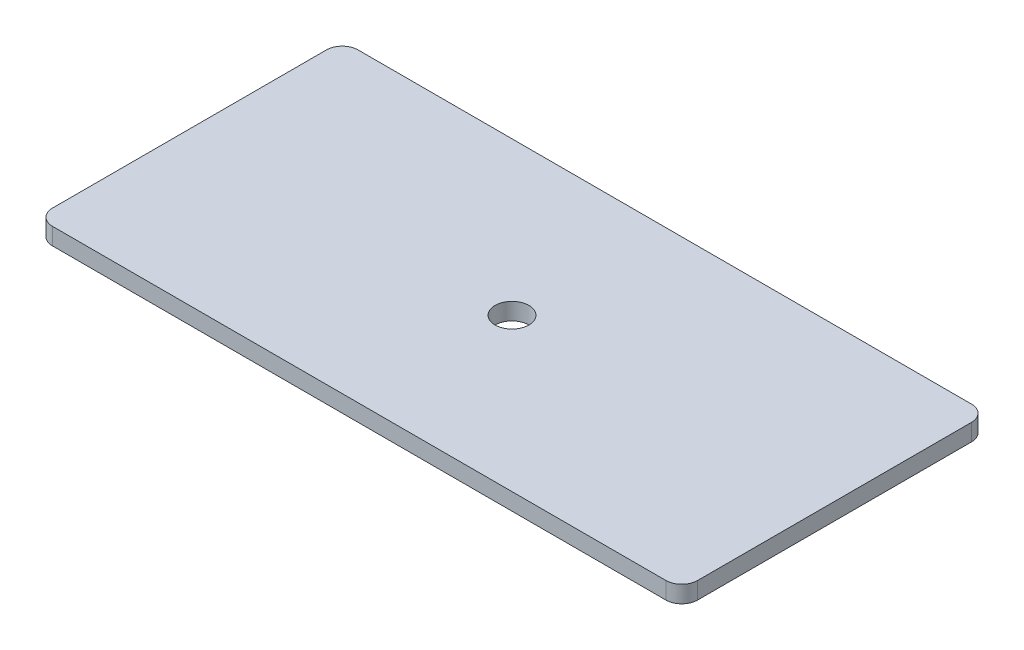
from build123d import *

# Parameters (mm, degrees)
BOSS_EXTRUDE1_DEPTH = 5
SKETCH2_R           = 5
CUT_EXTRUDE1_DEPTH  = 106.237825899


with BuildPart() as part:
    # Sketch1 → Boss-Extrude1 (new body)
    with BuildSketch(Plane(origin=(0, 0, 0), x_dir=(1, 0, 0), z_dir=(0, 1, 0))):
        with BuildLine():
            Line((95, -40.335774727), (95, 40.335774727))
            ThreePointArc((95, 40.335774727), (93.633880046, 43.633880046), (90.335774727, 45))
            Line((90.335774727, 45), (-90.335774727, 45))
            ThreePointArc((-90.335774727, 45), (-93.633880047, 43.633880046), (-95, 40.335774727))
            Line((-95, 40.335774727), (-95, -40.335774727))
            ThreePointArc((-95, -40.335774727), (-93.633880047, -43.633880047), (-90.335774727, -45))
            Line((-90.335774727, -45), (90.335774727, -45))
            ThreePointArc((90.335774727, -45), (93.633880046, -43.633880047), (95, -40.335774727))
        make_face()
    extrude(amount=BOSS_EXTRUDE1_DEPTH)

    # Sketch2 → Cut-Extrude1 (cut, through all)
    with BuildSketch(Plane(origin=(0, 5, 0), x_dir=(1, 0, 0), z_dir=(0, 1, 0))):
        with Locations(Location((0, 0, 0), (0, 0, 270))):
            Circle(SKETCH2_R)
    extrude(amount=-CUT_EXTRUDE1_DEPTH, mode=Mode.SUBTRACT)


solid = part.part
